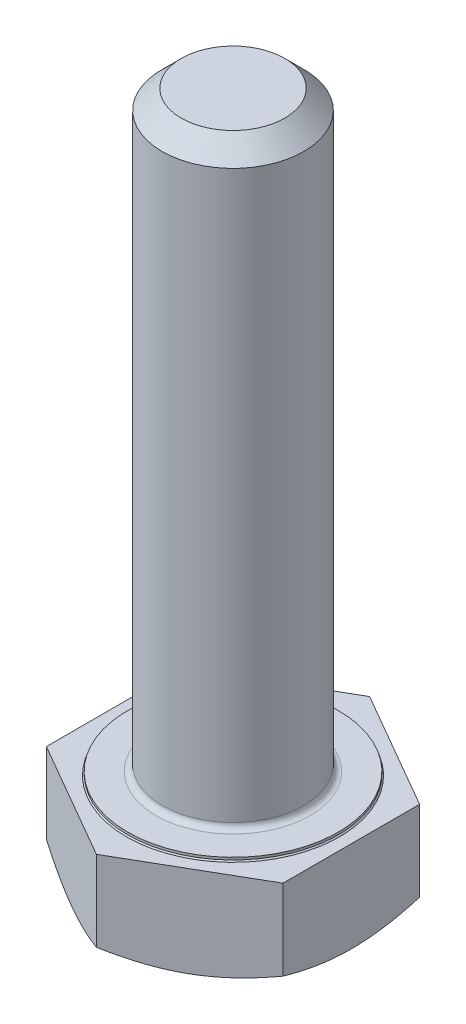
ISO-10303-21;
HEADER;
FILE_DESCRIPTION(('STEP AP214'),'2;1');
FILE_NAME('part.step','',(''),(''),'','','');
FILE_SCHEMA(('AUTOMOTIVE_DESIGN { 1 0 10303 214 1 1 1 1 }'));
ENDSEC;
DATA;
#1=APPLICATION_CONTEXT('core data for automotive mechanical design processes');
#2=APPLICATION_PROTOCOL_DEFINITION('international standard','automotive_design',2000,#1);
#3=PRODUCT_CONTEXT('',#1,'mechanical');
#4=PRODUCT('Part','Part','',(#3));
#5=PRODUCT_RELATED_PRODUCT_CATEGORY('part','',(#4));
#6=PRODUCT_DEFINITION_FORMATION('','',#4);
#7=PRODUCT_DEFINITION_CONTEXT('part definition',#1,'design');
#8=PRODUCT_DEFINITION('design','',#6,#7);
#9=PRODUCT_DEFINITION_SHAPE('','',#8);
#10=(LENGTH_UNIT() NAMED_UNIT(*) SI_UNIT(.MILLI.,.METRE.));
#11=(NAMED_UNIT(*) PLANE_ANGLE_UNIT() SI_UNIT($,.RADIAN.));
#12=(NAMED_UNIT(*) SI_UNIT($,.STERADIAN.) SOLID_ANGLE_UNIT());
#13=UNCERTAINTY_MEASURE_WITH_UNIT(LENGTH_MEASURE(1.E-05),#10,'distance_accuracy_value','');
#14=(GEOMETRIC_REPRESENTATION_CONTEXT(3) GLOBAL_UNCERTAINTY_ASSIGNED_CONTEXT((#13)) GLOBAL_UNIT_ASSIGNED_CONTEXT((#10,
#11,#12)) REPRESENTATION_CONTEXT('',''));
#15=CARTESIAN_POINT('',(0.,0.,0.));
#16=DIRECTION('',(0.,0.,1.));
#17=DIRECTION('',(1.,0.,0.));
#18=AXIS2_PLACEMENT_3D('',#15,#16,#17);
#19=CARTESIAN_POINT('',(0.,-4.,0.));
#20=DIRECTION('',(0.,-1.,0.));
#21=DIRECTION('',(0.,0.,-1.));
#22=AXIS2_PLACEMENT_3D('',#19,#20,#21);
#23=PLANE('',#22);
#24=CARTESIAN_POINT('',(0.,-4.00000000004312,0.));
#25=DIRECTION('',(0.,1.,0.));
#26=DIRECTION('',(0.,0.,1.));
#27=AXIS2_PLACEMENT_3D('',#24,#25,#26);
#28=CIRCLE('',#27,4.99999999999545);
#29=CARTESIAN_POINT('',(-4.99999999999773,-4.00000000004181,0.));
#30=VERTEX_POINT('',#29);
#31=CARTESIAN_POINT('',(-2.50000000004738,-4.00000000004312,4.33012701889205));
#32=VERTEX_POINT('',#31);
#33=EDGE_CURVE('E173',#30,#32,#28,.T.);
#34=ORIENTED_EDGE('',*,*,#33,.F.);
#35=CARTESIAN_POINT('',(0.,-4.00000000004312,0.));
#36=DIRECTION('',(0.,1.,0.));
#37=DIRECTION('',(0.,0.,1.));
#38=AXIS2_PLACEMENT_3D('',#35,#36,#37);
#39=CIRCLE('',#38,4.99999999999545);
#40=CARTESIAN_POINT('',(-2.50000000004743,-4.00000000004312,-4.33012701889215));
#41=VERTEX_POINT('',#40);
#42=EDGE_CURVE('E58',#41,#30,#39,.T.);
#43=ORIENTED_EDGE('',*,*,#42,.F.);
#44=CARTESIAN_POINT('',(0.,-4.00000000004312,0.));
#45=DIRECTION('',(0.,1.,0.));
#46=DIRECTION('',(0.,0.,1.));
#47=AXIS2_PLACEMENT_3D('',#44,#45,#46);
#48=CIRCLE('',#47,4.99999999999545);
#49=CARTESIAN_POINT('',(2.50000000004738,-4.00000000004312,-4.33012701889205));
#50=VERTEX_POINT('',#49);
#51=EDGE_CURVE('E75',#50,#41,#48,.T.);
#52=ORIENTED_EDGE('',*,*,#51,.F.);
#53=CARTESIAN_POINT('',(0.,-4.00000000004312,0.));
#54=DIRECTION('',(0.,1.,0.));
#55=DIRECTION('',(0.,0.,1.));
#56=AXIS2_PLACEMENT_3D('',#53,#54,#55);
#57=CIRCLE('',#56,4.99999999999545);
#58=CARTESIAN_POINT('',(4.99999999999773,-4.00000000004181,0.));
#59=VERTEX_POINT('',#58);
#60=EDGE_CURVE('E73',#59,#50,#57,.T.);
#61=ORIENTED_EDGE('',*,*,#60,.F.);
#62=CARTESIAN_POINT('',(0.,-4.00000000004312,0.));
#63=DIRECTION('',(0.,1.,0.));
#64=DIRECTION('',(0.,0.,1.));
#65=AXIS2_PLACEMENT_3D('',#62,#63,#64);
#66=CIRCLE('',#65,4.99999999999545);
#67=CARTESIAN_POINT('',(2.50000000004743,-4.00000000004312,4.33012701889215));
#68=VERTEX_POINT('',#67);
#69=EDGE_CURVE('E174',#68,#59,#66,.T.);
#70=ORIENTED_EDGE('',*,*,#69,.F.);
#71=CARTESIAN_POINT('',(0.,-4.00000000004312,0.));
#72=DIRECTION('',(0.,1.,0.));
#73=DIRECTION('',(0.,0.,1.));
#74=AXIS2_PLACEMENT_3D('',#71,#72,#73);
#75=CIRCLE('',#74,4.99999999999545);
#76=EDGE_CURVE('E169',#32,#68,#75,.T.);
#77=ORIENTED_EDGE('',*,*,#76,.F.);
#78=EDGE_LOOP('',(#34,#43,#52,#61,#70,#77));
#79=FACE_BOUND('',#78,.T.);
#80=ADVANCED_FACE('F41',(#79),#23,.T.);
#81=CARTESIAN_POINT('',(0.,-3.55073852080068,0.));
#82=DIRECTION('',(0.,1.,0.));
#83=DIRECTION('',(0.,0.,1.));
#84=AXIS2_PLACEMENT_3D('',#81,#82,#83);
#85=CONICAL_SURFACE('',#84,5.7781437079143,1.04719755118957);
#86=CARTESIAN_POINT('',(5.00000000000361,-3.55341801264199,-2.88675134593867));
#87=CARTESIAN_POINT('',(4.79650106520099,-3.62126800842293,-3.00424151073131));
#88=CARTESIAN_POINT('',(4.59137243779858,-3.68343045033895,-3.1226725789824));
#89=CARTESIAN_POINT('',(4.17930699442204,-3.79305279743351,-3.36057867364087));
#90=CARTESIAN_POINT('',(3.97238455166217,-3.84058540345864,-3.48004540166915));
#91=CARTESIAN_POINT('',(3.66004804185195,-3.89894737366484,-3.66037296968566));
#92=CARTESIAN_POINT('',(3.55554132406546,-3.91625229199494,-3.72070995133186));
#93=CARTESIAN_POINT('',(3.34602757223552,-3.94620746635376,-3.84167277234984));
#94=CARTESIAN_POINT('',(3.24102055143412,-3.9588578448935,-3.90229860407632));
#95=CARTESIAN_POINT('',(3.03011778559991,-3.97928167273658,-4.02406337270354));
#96=CARTESIAN_POINT('',(2.92422022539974,-3.9870303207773,-4.08520335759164));
#97=CARTESIAN_POINT('',(2.71221683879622,-3.99740020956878,-4.2076035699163));
#98=CARTESIAN_POINT('',(2.60611097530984,-4.00002043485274,-4.26886381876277));
#99=CARTESIAN_POINT('',(2.50000000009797,-4.00000000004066,-4.33012701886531));
#100=B_SPLINE_CURVE_WITH_KNOTS('',3,(#86,#87,#88,#89,#90,#91,#92,#93,#94,#95,#96,#97,#98,#99),
.UNSPECIFIED.,.F.,.F.,(4,2,2,2,2,2,4),(0.,0.73403665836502,1.46436443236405,1.83000749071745,
2.19564092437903,2.56310985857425,2.93065154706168),.UNSPECIFIED.);
#101=CARTESIAN_POINT('',(5.,-3.55341801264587,-2.886751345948));
#102=VERTEX_POINT('',#101);
#103=EDGE_CURVE('E158',#102,#50,#100,.T.);
#104=ORIENTED_EDGE('',*,*,#103,.F.);
#105=CARTESIAN_POINT('',(4.99999999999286,-4.00000000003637,0.));
#106=CARTESIAN_POINT('',(4.99999999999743,-4.0000204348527,-0.122526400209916));
#107=CARTESIAN_POINT('',(4.99999999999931,-3.99740020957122,-0.245046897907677));
#108=CARTESIAN_POINT('',(5.00000000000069,-3.98703032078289,-0.489847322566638));
#109=CARTESIAN_POINT('',(5.00000000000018,-3.97928167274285,-0.612127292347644));
#110=CARTESIAN_POINT('',(4.99999999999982,-3.95885784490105,-0.855656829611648));
#111=CARTESIAN_POINT('',(4.99999999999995,-3.9462074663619,-0.976908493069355));
#112=CARTESIAN_POINT('',(5.00000000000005,-3.91625229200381,-1.21883413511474));
#113=CARTESIAN_POINT('',(5.00000000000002,-3.89894737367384,-1.33950809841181));
#114=CARTESIAN_POINT('',(4.99999999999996,-3.84058540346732,-1.700163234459));
#115=CARTESIAN_POINT('',(4.99999999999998,-3.79305279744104,-1.9390966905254));
#116=CARTESIAN_POINT('',(5.00000000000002,-3.68343045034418,-2.41490887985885));
#117=CARTESIAN_POINT('',(5.00000000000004,-3.621268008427,-2.65177101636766));
#118=CARTESIAN_POINT('',(5.,-3.55341801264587,-2.88675134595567));
#119=B_SPLINE_CURVE_WITH_KNOTS('',3,(#105,#106,#107,#108,#109,#110,#111,#112,#113,#114,#115,
#116,#117,#118),.UNSPECIFIED.,.F.,.F.,(4,2,2,2,2,2,4),(0.,0.36754168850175,0.735010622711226,
1.10064405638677,1.46628711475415,2.19661488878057,2.93065154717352),.UNSPECIFIED.);
#120=EDGE_CURVE('E308',#59,#102,#119,.T.);
#121=ORIENTED_EDGE('',*,*,#120,.F.);
#122=ORIENTED_EDGE('',*,*,#60,.T.);
#123=EDGE_LOOP('',(#104,#121,#122));
#124=FACE_BOUND('',#123,.T.);
#125=ADVANCED_FACE('F314',(#124),#85,.T.);
#126=CARTESIAN_POINT('',(0.,-3.55073852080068,0.));
#127=DIRECTION('',(0.,1.,0.));
#128=DIRECTION('',(0.,0.,1.));
#129=AXIS2_PLACEMENT_3D('',#126,#127,#128);
#130=CONICAL_SURFACE('',#129,5.7781437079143,1.04719755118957);
#131=CARTESIAN_POINT('',(4.99999999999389,-3.55341801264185,2.88675134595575));
#132=CARTESIAN_POINT('',(4.99999999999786,-3.62126800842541,2.6517710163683));
#133=CARTESIAN_POINT('',(4.99999999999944,-3.6834304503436,2.41490887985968));
#134=CARTESIAN_POINT('',(5.00000000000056,-3.79305279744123,1.93909669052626));
#135=CARTESIAN_POINT('',(5.0000000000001,-3.84058540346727,1.70016323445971));
#136=CARTESIAN_POINT('',(4.99999999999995,-3.8989473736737,1.33950809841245));
#137=CARTESIAN_POINT('',(4.99999999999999,-3.91625229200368,1.21883413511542));
#138=CARTESIAN_POINT('',(5.00000000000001,-3.94620746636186,0.9769084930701));
#139=CARTESIAN_POINT('',(5.,-3.95885784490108,0.85565682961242));
#140=CARTESIAN_POINT('',(5.,-3.97928167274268,0.61212729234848));
#141=CARTESIAN_POINT('',(5.,-3.98703032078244,0.489847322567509));
#142=CARTESIAN_POINT('',(5.,-3.99740020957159,0.245046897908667));
#143=CARTESIAN_POINT('',(5.,-4.00002043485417,0.122526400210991));
#144=CARTESIAN_POINT('',(5.,-4.0000000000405,1.19058183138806E-12));
#145=B_SPLINE_CURVE_WITH_KNOTS('',3,(#131,#132,#133,#134,#135,#136,#137,#138,#139,#140,#141,
#142,#143,#144),.UNSPECIFIED.,.F.,.F.,(4,2,2,2,2,2,4),(0.,0.734036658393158,1.46436443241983,
1.83000749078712,2.19564092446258,2.56310985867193,2.9306515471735),.UNSPECIFIED.);
#146=CARTESIAN_POINT('',(5.,-3.55341801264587,2.886751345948));
#147=VERTEX_POINT('',#146);
#148=EDGE_CURVE('E268',#147,#59,#145,.T.);
#149=ORIENTED_EDGE('',*,*,#148,.F.);
#150=CARTESIAN_POINT('',(2.50000000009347,-4.0000000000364,4.33012701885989));
#151=CARTESIAN_POINT('',(2.60611097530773,-4.00002043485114,4.26886381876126));
#152=CARTESIAN_POINT('',(2.71221683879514,-3.99740020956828,4.20760356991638));
#153=CARTESIAN_POINT('',(2.92422022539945,-3.98703032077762,4.08520335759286));
#154=CARTESIAN_POINT('',(3.0301177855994,-3.97928167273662,4.02406337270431));
#155=CARTESIAN_POINT('',(3.24102055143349,-3.95885784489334,3.90229860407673));
#156=CARTESIAN_POINT('',(3.34602757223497,-3.94620746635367,3.84167277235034));
#157=CARTESIAN_POINT('',(3.55554132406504,-3.91625229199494,3.72070995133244));
#158=CARTESIAN_POINT('',(3.66004804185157,-3.89894737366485,3.66037296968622));
#159=CARTESIAN_POINT('',(3.97238455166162,-3.84058540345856,3.48004540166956));
#160=CARTESIAN_POINT('',(4.17930699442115,-3.7930527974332,3.36057867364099));
#161=CARTESIAN_POINT('',(4.5913724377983,-3.6834304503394,3.12267257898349));
#162=CARTESIAN_POINT('',(4.79650106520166,-3.62126800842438,3.00424151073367));
#163=CARTESIAN_POINT('',(5.00000000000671,-3.55341801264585,2.88675134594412));
#164=B_SPLINE_CURVE_WITH_KNOTS('',3,(#150,#151,#152,#153,#154,#155,#156,#157,#158,#159,#160,
#161,#162,#163),.UNSPECIFIED.,.F.,.F.,(4,2,2,2,2,2,4),(0.,0.367541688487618,0.735010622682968,
1.10064405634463,1.46628711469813,2.19661488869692,2.93065154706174),.UNSPECIFIED.);
#165=EDGE_CURVE('E243',#68,#147,#164,.T.);
#166=ORIENTED_EDGE('',*,*,#165,.F.);
#167=ORIENTED_EDGE('',*,*,#69,.T.);
#168=EDGE_LOOP('',(#149,#166,#167));
#169=FACE_BOUND('',#168,.T.);
#170=ADVANCED_FACE('F276',(#169),#130,.T.);
#171=CARTESIAN_POINT('',(0.,-3.55073852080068,0.));
#172=DIRECTION('',(0.,1.,0.));
#173=DIRECTION('',(0.,0.,1.));
#174=AXIS2_PLACEMENT_3D('',#171,#172,#173);
#175=CONICAL_SURFACE('',#174,5.7781437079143,1.04719755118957);
#176=CARTESIAN_POINT('',(-9.70357000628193E-12,-3.55341801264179,5.7735026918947));
#177=CARTESIAN_POINT('',(0.203498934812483,-3.621268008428,5.65601252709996));
#178=CARTESIAN_POINT('',(0.408627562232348,-3.68343045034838,5.53758145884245));
#179=CARTESIAN_POINT('',(0.820693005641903,-3.7930527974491,5.29967536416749));
#180=CARTESIAN_POINT('',(1.02761544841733,-3.84058540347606,5.18020863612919));
#181=CARTESIAN_POINT('',(1.33995195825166,-3.89894737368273,4.9998810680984));
#182=CARTESIAN_POINT('',(1.44445867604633,-3.9162522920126,4.93954408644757));
#183=CARTESIAN_POINT('',(1.65397242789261,-3.94620746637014,4.81858126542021));
#184=CARTESIAN_POINT('',(1.75897944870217,-3.95885784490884,4.757955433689));
#185=CARTESIAN_POINT('',(1.96988221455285,-3.97928167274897,4.63619066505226));
#186=CARTESIAN_POINT('',(2.07577977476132,-3.98703032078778,4.57505068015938));
#187=CARTESIAN_POINT('',(2.28778316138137,-3.99740020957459,4.45265046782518));
#188=CARTESIAN_POINT('',(2.39388902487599,-4.00002043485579,4.39139021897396));
#189=CARTESIAN_POINT('',(2.50000000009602,-4.00000000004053,4.33012701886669));
#190=B_SPLINE_CURVE_WITH_KNOTS('',3,(#176,#177,#178,#179,#180,#181,#182,#183,#184,#185,#186,
#187,#188,#189),.UNSPECIFIED.,.F.,.F.,(4,2,2,2,2,2,4),(0.,0.734036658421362,1.46436443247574,
1.83000749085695,2.19564092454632,2.56310985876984,2.93065154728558),.UNSPECIFIED.);
#191=CARTESIAN_POINT('',(0.,-3.55341801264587,5.77350269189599));
#192=VERTEX_POINT('',#191);
#193=EDGE_CURVE('E286',#192,#68,#190,.T.);
#194=ORIENTED_EDGE('',*,*,#193,.F.);
#195=CARTESIAN_POINT('',(-2.50000000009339,-4.00000000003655,4.33012701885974));
#196=CARTESIAN_POINT('',(-2.39388902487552,-4.00002043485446,4.39139021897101));
#197=CARTESIAN_POINT('',(-2.28778316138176,-3.99740020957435,4.4526504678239));
#198=CARTESIAN_POINT('',(-2.07577977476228,-3.98703032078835,4.57505068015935));
#199=CARTESIAN_POINT('',(-1.96988221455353,-3.97928167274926,4.63619066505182));
#200=CARTESIAN_POINT('',(-1.7589794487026,-3.95885784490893,4.75795543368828));
#201=CARTESIAN_POINT('',(-1.65397242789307,-3.94620746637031,4.81858126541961));
#202=CARTESIAN_POINT('',(-1.44445867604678,-3.91625229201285,4.93954408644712));
#203=CARTESIAN_POINT('',(-1.33995195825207,-3.89894737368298,4.99988106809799));
#204=CARTESIAN_POINT('',(-1.02761544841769,-3.84058540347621,5.18020863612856));
#205=CARTESIAN_POINT('',(-0.820693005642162,-3.793052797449,5.29967536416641));
#206=CARTESIAN_POINT('',(-0.40862756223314,-3.68343045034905,5.53758145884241));
#207=CARTESIAN_POINT('',(-0.20349893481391,-3.62126800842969,5.65601252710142));
#208=CARTESIAN_POINT('',(6.78572330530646E-12,-3.55341801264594,5.77350269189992));
#209=B_SPLINE_CURVE_WITH_KNOTS('',3,(#195,#196,#197,#198,#199,#200,#201,#202,#203,#204,#205,
#206,#207,#208),.UNSPECIFIED.,.F.,.F.,(4,2,2,2,2,2,4),(0.,0.367541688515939,0.735010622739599,
1.10064405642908,1.4662871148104,2.19661488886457,2.93065154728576),.UNSPECIFIED.);
#210=EDGE_CURVE('E242',#32,#192,#209,.T.);
#211=ORIENTED_EDGE('',*,*,#210,.F.);
#212=ORIENTED_EDGE('',*,*,#76,.T.);
#213=EDGE_LOOP('',(#194,#211,#212));
#214=FACE_BOUND('',#213,.T.);
#215=ADVANCED_FACE('F272',(#214),#175,.T.);
#216=CARTESIAN_POINT('',(0.,-3.55073852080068,0.));
#217=DIRECTION('',(0.,1.,0.));
#218=DIRECTION('',(0.,0.,1.));
#219=AXIS2_PLACEMENT_3D('',#216,#217,#218);
#220=CONICAL_SURFACE('',#219,5.7781437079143,1.04719755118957);
#221=CARTESIAN_POINT('',(-5.00000000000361,-3.55341801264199,2.88675134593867));
#222=CARTESIAN_POINT('',(-4.79650106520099,-3.62126800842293,3.00424151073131));
#223=CARTESIAN_POINT('',(-4.59137243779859,-3.68343045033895,3.1226725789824));
#224=CARTESIAN_POINT('',(-4.17930699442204,-3.79305279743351,3.36057867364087));
#225=CARTESIAN_POINT('',(-3.97238455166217,-3.84058540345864,3.48004540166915));
#226=CARTESIAN_POINT('',(-3.66004804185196,-3.89894737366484,3.66037296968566));
#227=CARTESIAN_POINT('',(-3.55554132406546,-3.91625229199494,3.72070995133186));
#228=CARTESIAN_POINT('',(-3.34602757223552,-3.94620746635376,3.84167277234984));
#229=CARTESIAN_POINT('',(-3.24102055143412,-3.9588578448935,3.90229860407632));
#230=CARTESIAN_POINT('',(-3.03011778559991,-3.97928167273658,4.02406337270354));
#231=CARTESIAN_POINT('',(-2.92422022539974,-3.9870303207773,4.08520335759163));
#232=CARTESIAN_POINT('',(-2.71221683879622,-3.99740020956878,4.2076035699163));
#233=CARTESIAN_POINT('',(-2.60611097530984,-4.00002043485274,4.26886381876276));
#234=CARTESIAN_POINT('',(-2.50000000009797,-4.00000000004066,4.33012701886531));
#235=B_SPLINE_CURVE_WITH_KNOTS('',3,(#221,#222,#223,#224,#225,#226,#227,#228,#229,#230,#231,
#232,#233,#234),.UNSPECIFIED.,.F.,.F.,(4,2,2,2,2,2,4),(0.,0.734036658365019,1.46436443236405,
1.83000749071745,2.19564092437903,2.56310985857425,2.93065154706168),.UNSPECIFIED.);
#236=CARTESIAN_POINT('',(-5.,-3.55341801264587,2.8867513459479));
#237=VERTEX_POINT('',#236);
#238=EDGE_CURVE('E238',#237,#32,#235,.T.);
#239=ORIENTED_EDGE('',*,*,#238,.F.);
#240=CARTESIAN_POINT('',(-4.99999999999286,-4.00000000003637,0.));
#241=CARTESIAN_POINT('',(-4.99999999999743,-4.0000204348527,0.122526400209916));
#242=CARTESIAN_POINT('',(-4.99999999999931,-3.99740020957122,0.245046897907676));
#243=CARTESIAN_POINT('',(-5.00000000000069,-3.98703032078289,0.489847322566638));
#244=CARTESIAN_POINT('',(-5.00000000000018,-3.97928167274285,0.612127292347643));
#245=CARTESIAN_POINT('',(-4.99999999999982,-3.95885784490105,0.855656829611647));
#246=CARTESIAN_POINT('',(-4.99999999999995,-3.9462074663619,0.976908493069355));
#247=CARTESIAN_POINT('',(-5.00000000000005,-3.91625229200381,1.21883413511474));
#248=CARTESIAN_POINT('',(-5.00000000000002,-3.89894737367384,1.33950809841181));
#249=CARTESIAN_POINT('',(-4.99999999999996,-3.84058540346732,1.700163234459));
#250=CARTESIAN_POINT('',(-4.99999999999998,-3.79305279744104,1.9390966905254));
#251=CARTESIAN_POINT('',(-5.00000000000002,-3.68343045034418,2.41490887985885));
#252=CARTESIAN_POINT('',(-5.00000000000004,-3.621268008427,2.65177101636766));
#253=CARTESIAN_POINT('',(-5.,-3.55341801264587,2.88675134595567));
#254=B_SPLINE_CURVE_WITH_KNOTS('',3,(#240,#241,#242,#243,#244,#245,#246,#247,#248,#249,#250,
#251,#252,#253),.UNSPECIFIED.,.F.,.F.,(4,2,2,2,2,2,4),(0.,0.36754168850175,0.735010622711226,
1.10064405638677,1.46628711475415,2.19661488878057,2.93065154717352),.UNSPECIFIED.);
#255=EDGE_CURVE('E249',#30,#237,#254,.T.);
#256=ORIENTED_EDGE('',*,*,#255,.F.);
#257=ORIENTED_EDGE('',*,*,#33,.T.);
#258=EDGE_LOOP('',(#239,#256,#257));
#259=FACE_BOUND('',#258,.T.);
#260=ADVANCED_FACE('F206',(#259),#220,.T.);
#261=CARTESIAN_POINT('',(0.,-3.55073852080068,0.));
#262=DIRECTION('',(0.,1.,0.));
#263=DIRECTION('',(0.,0.,1.));
#264=AXIS2_PLACEMENT_3D('',#261,#262,#263);
#265=CONICAL_SURFACE('',#264,5.7781437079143,1.04719755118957);
#266=CARTESIAN_POINT('',(9.67539593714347E-12,-3.55341801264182,-5.77350269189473));
#267=CARTESIAN_POINT('',(-0.203498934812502,-3.62126800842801,-5.65601252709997));
#268=CARTESIAN_POINT('',(-0.408627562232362,-3.68343045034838,-5.53758145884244));
#269=CARTESIAN_POINT('',(-0.820693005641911,-3.7930527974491,-5.29967536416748));
#270=CARTESIAN_POINT('',(-1.02761544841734,-3.84058540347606,-5.18020863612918));
#271=CARTESIAN_POINT('',(-1.33995195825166,-3.89894737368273,-4.9998810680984));
#272=CARTESIAN_POINT('',(-1.44445867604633,-3.9162522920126,-4.93954408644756));
#273=CARTESIAN_POINT('',(-1.65397242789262,-3.94620746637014,-4.81858126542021));
#274=CARTESIAN_POINT('',(-1.75897944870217,-3.95885784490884,-4.757955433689));
#275=CARTESIAN_POINT('',(-1.96988221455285,-3.97928167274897,-4.63619066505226));
#276=CARTESIAN_POINT('',(-2.07577977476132,-3.98703032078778,-4.57505068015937));
#277=CARTESIAN_POINT('',(-2.28778316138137,-3.99740020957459,-4.45265046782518));
#278=CARTESIAN_POINT('',(-2.39388902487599,-4.00002043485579,-4.39139021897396));
#279=CARTESIAN_POINT('',(-2.50000000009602,-4.00000000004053,-4.33012701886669));
#280=B_SPLINE_CURVE_WITH_KNOTS('',3,(#266,#267,#268,#269,#270,#271,#272,#273,#274,#275,#276,
#277,#278,#279),.UNSPECIFIED.,.F.,.F.,(4,2,2,2,2,2,4),(0.,0.734036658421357,1.46436443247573,
1.83000749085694,2.19564092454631,2.56310985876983,2.93065154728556),.UNSPECIFIED.);
#281=CARTESIAN_POINT('',(0.,-3.55341801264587,-5.773502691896));
#282=VERTEX_POINT('',#281);
#283=EDGE_CURVE('E195',#282,#41,#280,.T.);
#284=ORIENTED_EDGE('',*,*,#283,.F.);
#285=CARTESIAN_POINT('',(2.50000000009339,-4.00000000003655,-4.33012701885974));
#286=CARTESIAN_POINT('',(2.39388902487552,-4.00002043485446,-4.39139021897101));
#287=CARTESIAN_POINT('',(2.28778316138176,-3.99740020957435,-4.4526504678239));
#288=CARTESIAN_POINT('',(2.07577977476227,-3.98703032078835,-4.57505068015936));
#289=CARTESIAN_POINT('',(1.96988221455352,-3.97928167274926,-4.63619066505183));
#290=CARTESIAN_POINT('',(1.75897944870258,-3.95885784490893,-4.75795543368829));
#291=CARTESIAN_POINT('',(1.65397242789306,-3.94620746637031,-4.81858126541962));
#292=CARTESIAN_POINT('',(1.44445867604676,-3.91625229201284,-4.93954408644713));
#293=CARTESIAN_POINT('',(1.33995195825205,-3.89894737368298,-4.999881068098));
#294=CARTESIAN_POINT('',(1.02761544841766,-3.84058540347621,-5.18020863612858));
#295=CARTESIAN_POINT('',(0.820693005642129,-3.793052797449,-5.29967536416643));
#296=CARTESIAN_POINT('',(0.408627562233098,-3.68343045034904,-5.53758145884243));
#297=CARTESIAN_POINT('',(0.203498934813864,-3.62126800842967,-5.65601252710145));
#298=CARTESIAN_POINT('',(-6.83455675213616E-12,-3.55341801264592,-5.77350269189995));
#299=B_SPLINE_CURVE_WITH_KNOTS('',3,(#285,#286,#287,#288,#289,#290,#291,#292,#293,#294,#295,
#296,#297,#298),.UNSPECIFIED.,.F.,.F.,(4,2,2,2,2,2,4),(0.,0.367541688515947,0.735010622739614,
1.1006440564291,1.46628711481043,2.19661488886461,2.93065154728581),.UNSPECIFIED.);
#300=EDGE_CURVE('E143',#50,#282,#299,.T.);
#301=ORIENTED_EDGE('',*,*,#300,.F.);
#302=ORIENTED_EDGE('',*,*,#51,.T.);
#303=EDGE_LOOP('',(#284,#301,#302));
#304=FACE_BOUND('',#303,.T.);
#305=ADVANCED_FACE('F201',(#304),#265,.T.);
#306=CARTESIAN_POINT('',(0.,-3.55073852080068,0.));
#307=DIRECTION('',(0.,1.,0.));
#308=DIRECTION('',(0.,0.,1.));
#309=AXIS2_PLACEMENT_3D('',#306,#307,#308);
#310=CONICAL_SURFACE('',#309,5.7781437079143,1.04719755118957);
#311=CARTESIAN_POINT('',(-4.99999999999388,-3.55341801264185,-2.88675134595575));
#312=CARTESIAN_POINT('',(-4.99999999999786,-3.62126800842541,-2.6517710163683));
#313=CARTESIAN_POINT('',(-4.99999999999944,-3.6834304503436,-2.41490887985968));
#314=CARTESIAN_POINT('',(-5.00000000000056,-3.79305279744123,-1.93909669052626));
#315=CARTESIAN_POINT('',(-5.0000000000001,-3.84058540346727,-1.70016323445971));
#316=CARTESIAN_POINT('',(-4.99999999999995,-3.8989473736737,-1.33950809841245));
#317=CARTESIAN_POINT('',(-4.99999999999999,-3.91625229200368,-1.21883413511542));
#318=CARTESIAN_POINT('',(-5.00000000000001,-3.94620746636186,-0.9769084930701));
#319=CARTESIAN_POINT('',(-5.,-3.95885784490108,-0.855656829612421));
#320=CARTESIAN_POINT('',(-5.,-3.97928167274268,-0.612127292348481));
#321=CARTESIAN_POINT('',(-5.,-3.98703032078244,-0.48984732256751));
#322=CARTESIAN_POINT('',(-5.,-3.99740020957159,-0.245046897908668));
#323=CARTESIAN_POINT('',(-5.,-4.00002043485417,-0.122526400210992));
#324=CARTESIAN_POINT('',(-5.,-4.0000000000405,-1.19123229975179E-12));
#325=B_SPLINE_CURVE_WITH_KNOTS('',3,(#311,#312,#313,#314,#315,#316,#317,#318,#319,#320,#321,
#322,#323,#324),.UNSPECIFIED.,.F.,.F.,(4,2,2,2,2,2,4),(0.,0.734036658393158,1.46436443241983,
1.83000749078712,2.19564092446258,2.56310985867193,2.9306515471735),.UNSPECIFIED.);
#326=CARTESIAN_POINT('',(-5.,-3.55341801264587,-2.886751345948));
#327=VERTEX_POINT('',#326);
#328=EDGE_CURVE('E218',#327,#30,#325,.T.);
#329=ORIENTED_EDGE('',*,*,#328,.F.);
#330=CARTESIAN_POINT('',(-2.50000000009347,-4.0000000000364,-4.33012701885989));
#331=CARTESIAN_POINT('',(-2.60611097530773,-4.00002043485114,-4.26886381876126));
#332=CARTESIAN_POINT('',(-2.71221683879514,-3.99740020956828,-4.20760356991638));
#333=CARTESIAN_POINT('',(-2.92422022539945,-3.98703032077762,-4.08520335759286));
#334=CARTESIAN_POINT('',(-3.0301177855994,-3.97928167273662,-4.02406337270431));
#335=CARTESIAN_POINT('',(-3.24102055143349,-3.95885784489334,-3.90229860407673));
#336=CARTESIAN_POINT('',(-3.34602757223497,-3.94620746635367,-3.84167277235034));
#337=CARTESIAN_POINT('',(-3.55554132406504,-3.91625229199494,-3.72070995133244));
#338=CARTESIAN_POINT('',(-3.66004804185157,-3.89894737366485,-3.66037296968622));
#339=CARTESIAN_POINT('',(-3.97238455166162,-3.84058540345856,-3.48004540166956));
#340=CARTESIAN_POINT('',(-4.17930699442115,-3.7930527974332,-3.36057867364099));
#341=CARTESIAN_POINT('',(-4.5913724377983,-3.6834304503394,-3.12267257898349));
#342=CARTESIAN_POINT('',(-4.79650106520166,-3.62126800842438,-3.00424151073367));
#343=CARTESIAN_POINT('',(-5.00000000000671,-3.55341801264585,-2.88675134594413));
#344=B_SPLINE_CURVE_WITH_KNOTS('',3,(#330,#331,#332,#333,#334,#335,#336,#337,#338,#339,#340,
#341,#342,#343),.UNSPECIFIED.,.F.,.F.,(4,2,2,2,2,2,4),(0.,0.367541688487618,0.735010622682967,
1.10064405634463,1.46628711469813,2.19661488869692,2.93065154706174),.UNSPECIFIED.);
#345=EDGE_CURVE('E237',#41,#327,#344,.T.);
#346=ORIENTED_EDGE('',*,*,#345,.F.);
#347=ORIENTED_EDGE('',*,*,#42,.T.);
#348=EDGE_LOOP('',(#329,#346,#347));
#349=FACE_BOUND('',#348,.T.);
#350=ADVANCED_FACE('F205',(#349),#310,.T.);
#351=CARTESIAN_POINT('',(0.,0.,-5.773502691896));
#352=DIRECTION('',(0.500000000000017,0.,-0.866025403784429));
#353=DIRECTION('',(-0.866025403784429,0.,-0.500000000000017));
#354=AXIS2_PLACEMENT_3D('',#351,#352,#353);
#355=PLANE('',#354);
#356=ORIENTED_EDGE('',*,*,#300,.T.);
#357=DIRECTION('',(0.,-1.,0.));
#358=VECTOR('',#357,1.);
#359=CARTESIAN_POINT('',(0.,-0.15,-5.773502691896));
#360=LINE('',#359,#358);
#361=CARTESIAN_POINT('',(0.,-0.15,-5.773502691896));
#362=VERTEX_POINT('',#361);
#363=EDGE_CURVE('E139',#362,#282,#360,.T.);
#364=ORIENTED_EDGE('',*,*,#363,.F.);
#365=DIRECTION('',(-0.866025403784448,0.,-0.499999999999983));
#366=VECTOR('',#365,1.);
#367=CARTESIAN_POINT('',(0.,-0.15,-5.773502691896));
#368=LINE('',#367,#366);
#369=CARTESIAN_POINT('',(5.,-0.15,-2.886751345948));
#370=VERTEX_POINT('',#369);
#371=EDGE_CURVE('E128',#370,#362,#368,.T.);
#372=ORIENTED_EDGE('',*,*,#371,.F.);
#373=DIRECTION('',(0.,-1.,0.));
#374=VECTOR('',#373,1.);
#375=CARTESIAN_POINT('',(5.,-0.15,-2.886751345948));
#376=LINE('',#375,#374);
#377=EDGE_CURVE('E147',#370,#102,#376,.T.);
#378=ORIENTED_EDGE('',*,*,#377,.T.);
#379=ORIENTED_EDGE('',*,*,#103,.T.);
#380=EDGE_LOOP('',(#356,#364,#372,#378,#379));
#381=FACE_BOUND('',#380,.T.);
#382=ADVANCED_FACE('F140',(#381),#355,.T.);
#383=CARTESIAN_POINT('',(5.,0.,-2.886751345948));
#384=DIRECTION('',(1.,0.,0.));
#385=DIRECTION('',(0.,0.,-1.));
#386=AXIS2_PLACEMENT_3D('',#383,#384,#385);
#387=PLANE('',#386);
#388=ORIENTED_EDGE('',*,*,#120,.T.);
#389=ORIENTED_EDGE('',*,*,#377,.F.);
#390=DIRECTION('',(0.,0.,-1.));
#391=VECTOR('',#390,1.);
#392=CARTESIAN_POINT('',(5.,-0.15,-2.886751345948));
#393=LINE('',#392,#391);
#394=CARTESIAN_POINT('',(5.,-0.15,2.886751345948));
#395=VERTEX_POINT('',#394);
#396=EDGE_CURVE('E134',#395,#370,#393,.T.);
#397=ORIENTED_EDGE('',*,*,#396,.F.);
#398=DIRECTION('',(0.,-1.,0.));
#399=VECTOR('',#398,1.);
#400=CARTESIAN_POINT('',(5.,-0.15,2.886751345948));
#401=LINE('',#400,#399);
#402=EDGE_CURVE('E702',#395,#147,#401,.T.);
#403=ORIENTED_EDGE('',*,*,#402,.T.);
#404=ORIENTED_EDGE('',*,*,#148,.T.);
#405=EDGE_LOOP('',(#388,#389,#397,#403,#404));
#406=FACE_BOUND('',#405,.T.);
#407=ADVANCED_FACE('F312',(#406),#387,.T.);
#408=CARTESIAN_POINT('',(5.,0.,2.886751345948));
#409=DIRECTION('',(0.500000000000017,0.,0.866025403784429));
#410=DIRECTION('',(0.866025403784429,0.,-0.500000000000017));
#411=AXIS2_PLACEMENT_3D('',#408,#409,#410);
#412=PLANE('',#411);
#413=ORIENTED_EDGE('',*,*,#165,.T.);
#414=ORIENTED_EDGE('',*,*,#402,.F.);
#415=DIRECTION('',(0.866025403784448,0.,-0.499999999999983));
#416=VECTOR('',#415,1.);
#417=CARTESIAN_POINT('',(5.,-0.15,2.886751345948));
#418=LINE('',#417,#416);
#419=CARTESIAN_POINT('',(0.,-0.15,5.77350269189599));
#420=VERTEX_POINT('',#419);
#421=EDGE_CURVE('E121',#420,#395,#418,.T.);
#422=ORIENTED_EDGE('',*,*,#421,.F.);
#423=DIRECTION('',(0.,-1.,0.));
#424=VECTOR('',#423,1.);
#425=CARTESIAN_POINT('',(0.,-0.15,5.77350269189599));
#426=LINE('',#425,#424);
#427=EDGE_CURVE('E182',#420,#192,#426,.T.);
#428=ORIENTED_EDGE('',*,*,#427,.T.);
#429=ORIENTED_EDGE('',*,*,#193,.T.);
#430=EDGE_LOOP('',(#413,#414,#422,#428,#429));
#431=FACE_BOUND('',#430,.T.);
#432=ADVANCED_FACE('F257',(#431),#412,.T.);
#433=CARTESIAN_POINT('',(0.,0.,5.773502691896));
#434=DIRECTION('',(-0.500000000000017,0.,0.866025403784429));
#435=DIRECTION('',(0.866025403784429,0.,0.500000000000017));
#436=AXIS2_PLACEMENT_3D('',#433,#434,#435);
#437=PLANE('',#436);
#438=ORIENTED_EDGE('',*,*,#210,.T.);
#439=ORIENTED_EDGE('',*,*,#427,.F.);
#440=DIRECTION('',(0.866025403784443,0.,0.499999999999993));
#441=VECTOR('',#440,1.);
#442=CARTESIAN_POINT('',(0.,-0.15,5.77350269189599));
#443=LINE('',#442,#441);
#444=CARTESIAN_POINT('',(-5.,-0.15,2.8867513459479));
#445=VERTEX_POINT('',#444);
#446=EDGE_CURVE('E716',#445,#420,#443,.T.);
#447=ORIENTED_EDGE('',*,*,#446,.F.);
#448=DIRECTION('',(0.,-1.,0.));
#449=VECTOR('',#448,1.);
#450=CARTESIAN_POINT('',(-5.,-0.15,2.8867513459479));
#451=LINE('',#450,#449);
#452=EDGE_CURVE('E113',#445,#237,#451,.T.);
#453=ORIENTED_EDGE('',*,*,#452,.T.);
#454=ORIENTED_EDGE('',*,*,#238,.T.);
#455=EDGE_LOOP('',(#438,#439,#447,#453,#454));
#456=FACE_BOUND('',#455,.T.);
#457=ADVANCED_FACE('F253',(#456),#437,.T.);
#458=CARTESIAN_POINT('',(-5.,0.,2.886751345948));
#459=DIRECTION('',(-1.,0.,0.));
#460=DIRECTION('',(0.,0.,1.));
#461=AXIS2_PLACEMENT_3D('',#458,#459,#460);
#462=PLANE('',#461);
#463=ORIENTED_EDGE('',*,*,#255,.T.);
#464=ORIENTED_EDGE('',*,*,#452,.F.);
#465=DIRECTION('',(0.,0.,1.));
#466=VECTOR('',#465,1.);
#467=CARTESIAN_POINT('',(-5.,-0.15,2.8867513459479));
#468=LINE('',#467,#466);
#469=CARTESIAN_POINT('',(-5.,-0.15,-2.886751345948));
#470=VERTEX_POINT('',#469);
#471=EDGE_CURVE('E90',#470,#445,#468,.T.);
#472=ORIENTED_EDGE('',*,*,#471,.F.);
#473=DIRECTION('',(0.,-1.,0.));
#474=VECTOR('',#473,1.);
#475=CARTESIAN_POINT('',(-5.,-0.15,-2.886751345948));
#476=LINE('',#475,#474);
#477=EDGE_CURVE('E82',#470,#327,#476,.T.);
#478=ORIENTED_EDGE('',*,*,#477,.T.);
#479=ORIENTED_EDGE('',*,*,#328,.T.);
#480=EDGE_LOOP('',(#463,#464,#472,#478,#479));
#481=FACE_BOUND('',#480,.T.);
#482=ADVANCED_FACE('F226',(#481),#462,.T.);
#483=CARTESIAN_POINT('',(-5.,0.,-2.886751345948));
#484=DIRECTION('',(-0.500000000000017,0.,-0.866025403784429));
#485=DIRECTION('',(-0.866025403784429,0.,0.500000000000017));
#486=AXIS2_PLACEMENT_3D('',#483,#484,#485);
#487=PLANE('',#486);
#488=ORIENTED_EDGE('',*,*,#345,.T.);
#489=ORIENTED_EDGE('',*,*,#477,.F.);
#490=DIRECTION('',(-0.866025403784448,0.,0.499999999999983));
#491=VECTOR('',#490,1.);
#492=CARTESIAN_POINT('',(-5.,-0.15,-2.886751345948));
#493=LINE('',#492,#491);
#494=EDGE_CURVE('E132',#362,#470,#493,.T.);
#495=ORIENTED_EDGE('',*,*,#494,.F.);
#496=ORIENTED_EDGE('',*,*,#363,.T.);
#497=ORIENTED_EDGE('',*,*,#283,.T.);
#498=EDGE_LOOP('',(#488,#489,#495,#496,#497));
#499=FACE_BOUND('',#498,.T.);
#500=ADVANCED_FACE('F150',(#499),#487,.T.);
#501=CARTESIAN_POINT('',(0.,-0.15,0.));
#502=DIRECTION('',(0.,-1.,0.));
#503=DIRECTION('',(0.,0.,-1.));
#504=AXIS2_PLACEMENT_3D('',#501,#502,#503);
#505=PLANE('',#504);
#506=CARTESIAN_POINT('',(0.,-0.15,0.));
#507=DIRECTION('',(0.,-1.,0.));
#508=DIRECTION('',(0.,0.,-1.));
#509=AXIS2_PLACEMENT_3D('',#506,#507,#508);
#510=CIRCLE('',#509,4.50000000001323);
#511=CARTESIAN_POINT('',(0.,-0.15,-4.50000000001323));
#512=VERTEX_POINT('',#511);
#513=EDGE_CURVE('E486',#512,#512,#510,.T.);
#514=ORIENTED_EDGE('',*,*,#513,.T.);
#515=EDGE_LOOP('',(#514));
#516=FACE_BOUND('',#515,.T.);
#517=ORIENTED_EDGE('',*,*,#446,.T.);
#518=ORIENTED_EDGE('',*,*,#421,.T.);
#519=ORIENTED_EDGE('',*,*,#396,.T.);
#520=ORIENTED_EDGE('',*,*,#371,.T.);
#521=ORIENTED_EDGE('',*,*,#494,.T.);
#522=ORIENTED_EDGE('',*,*,#471,.T.);
#523=EDGE_LOOP('',(#517,#518,#519,#520,#521,#522));
#524=FACE_BOUND('',#523,.T.);
#525=ADVANCED_FACE('F130',(#516,#524),#505,.F.);
#526=CARTESIAN_POINT('',(0.,25.,0.));
#527=DIRECTION('',(0.,-1.,0.));
#528=DIRECTION('',(0.,0.,-1.));
#529=AXIS2_PLACEMENT_3D('',#526,#527,#528);
#530=CYLINDRICAL_SURFACE('',#529,3.);
#531=CARTESIAN_POINT('',(0.,0.25,0.));
#532=DIRECTION('',(0.,1.,0.));
#533=DIRECTION('',(0.,0.,1.));
#534=AXIS2_PLACEMENT_3D('',#531,#532,#533);
#535=CIRCLE('',#534,3.);
#536=CARTESIAN_POINT('',(0.,0.25,3.));
#537=VERTEX_POINT('',#536);
#538=EDGE_CURVE('E13',#537,#537,#535,.T.);
#539=ORIENTED_EDGE('',*,*,#538,.T.);
#540=EDGE_LOOP('',(#539));
#541=FACE_BOUND('',#540,.T.);
#542=CARTESIAN_POINT('',(0.,24.1881249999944,0.));
#543=DIRECTION('',(0.,1.,0.));
#544=DIRECTION('',(0.,0.,1.));
#545=AXIS2_PLACEMENT_3D('',#542,#543,#544);
#546=CIRCLE('',#545,3.);
#547=CARTESIAN_POINT('',(0.,24.1881249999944,3.));
#548=VERTEX_POINT('',#547);
#549=EDGE_CURVE('E476',#548,#548,#546,.F.);
#550=ORIENTED_EDGE('',*,*,#549,.T.);
#551=EDGE_LOOP('',(#550));
#552=FACE_BOUND('',#551,.T.);
#553=ADVANCED_FACE('F511',(#541,#552),#530,.T.);
#554=CARTESIAN_POINT('',(3.,25.,0.));
#555=DIRECTION('',(0.,1.,0.));
#556=DIRECTION('',(0.,0.,1.));
#557=AXIS2_PLACEMENT_3D('',#554,#555,#556);
#558=PLANE('',#557);
#559=CARTESIAN_POINT('',(0.,25.,0.));
#560=DIRECTION('',(0.,1.,0.));
#561=DIRECTION('',(0.,0.,1.));
#562=AXIS2_PLACEMENT_3D('',#559,#560,#561);
#563=CIRCLE('',#562,2.18812499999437);
#564=CARTESIAN_POINT('',(0.,25.,2.18812499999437));
#565=VERTEX_POINT('',#564);
#566=EDGE_CURVE('E481',#565,#565,#563,.T.);
#567=ORIENTED_EDGE('',*,*,#566,.T.);
#568=EDGE_LOOP('',(#567));
#569=FACE_BOUND('',#568,.T.);
#570=ADVANCED_FACE('F513',(#569),#558,.T.);
#571=CARTESIAN_POINT('',(0.,25.,0.));
#572=DIRECTION('',(0.,-1.,0.));
#573=DIRECTION('',(0.,0.,-1.));
#574=AXIS2_PLACEMENT_3D('',#571,#572,#573);
#575=CYLINDRICAL_SURFACE('',#574,4.45);
#576=CARTESIAN_POINT('',(0.,-0.0999999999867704,0.));
#577=DIRECTION('',(0.,-1.,0.));
#578=DIRECTION('',(0.,0.,-1.));
#579=AXIS2_PLACEMENT_3D('',#576,#577,#578);
#580=CIRCLE('',#579,4.45);
#581=CARTESIAN_POINT('',(0.,-0.0999999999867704,-4.45));
#582=VERTEX_POINT('',#581);
#583=EDGE_CURVE('E493',#582,#582,#580,.F.);
#584=ORIENTED_EDGE('',*,*,#583,.T.);
#585=EDGE_LOOP('',(#584));
#586=FACE_BOUND('',#585,.T.);
#587=CARTESIAN_POINT('',(0.,0.,0.));
#588=DIRECTION('',(0.,-1.,0.));
#589=DIRECTION('',(0.,0.,-1.));
#590=AXIS2_PLACEMENT_3D('',#587,#588,#589);
#591=CIRCLE('',#590,4.45);
#592=CARTESIAN_POINT('',(0.,0.,-4.45));
#593=VERTEX_POINT('',#592);
#594=EDGE_CURVE('E717',#593,#593,#591,.T.);
#595=ORIENTED_EDGE('',*,*,#594,.T.);
#596=EDGE_LOOP('',(#595));
#597=FACE_BOUND('',#596,.T.);
#598=ADVANCED_FACE('F518',(#586,#597),#575,.T.);
#599=CARTESIAN_POINT('',(4.45,0.,0.));
#600=DIRECTION('',(0.,1.,0.));
#601=DIRECTION('',(0.,0.,1.));
#602=AXIS2_PLACEMENT_3D('',#599,#600,#601);
#603=PLANE('',#602);
#604=CARTESIAN_POINT('',(0.,0.,0.));
#605=DIRECTION('',(0.,1.,0.));
#606=DIRECTION('',(0.,0.,1.));
#607=AXIS2_PLACEMENT_3D('',#604,#605,#606);
#608=CIRCLE('',#607,3.25);
#609=CARTESIAN_POINT('',(0.,0.,3.25));
#610=VERTEX_POINT('',#609);
#611=EDGE_CURVE('E50',#610,#610,#608,.F.);
#612=ORIENTED_EDGE('',*,*,#611,.T.);
#613=EDGE_LOOP('',(#612));
#614=FACE_BOUND('',#613,.T.);
#615=ORIENTED_EDGE('',*,*,#594,.F.);
#616=EDGE_LOOP('',(#615));
#617=FACE_BOUND('',#616,.T.);
#618=ADVANCED_FACE('F498',(#614,#617),#603,.T.);
#619=CARTESIAN_POINT('',(0.,24.1881249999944,0.));
#620=DIRECTION('',(0.,-1.,0.));
#621=DIRECTION('',(0.,0.,-1.));
#622=AXIS2_PLACEMENT_3D('',#619,#620,#621);
#623=CONICAL_SURFACE('',#622,3.,0.785398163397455);
#624=ORIENTED_EDGE('',*,*,#566,.F.);
#625=EDGE_LOOP('',(#624));
#626=FACE_BOUND('',#625,.T.);
#627=ORIENTED_EDGE('',*,*,#549,.F.);
#628=EDGE_LOOP('',(#627));
#629=FACE_BOUND('',#628,.T.);
#630=ADVANCED_FACE('F507',(#626,#629),#623,.T.);
#631=CARTESIAN_POINT('',(0.,-0.150000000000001,0.));
#632=DIRECTION('',(0.,-1.,0.));
#633=DIRECTION('',(0.,0.,-1.));
#634=AXIS2_PLACEMENT_3D('',#631,#632,#633);
#635=CONICAL_SURFACE('',#634,4.50000000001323,0.78539816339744);
#636=CARTESIAN_POINT('',(0.,-0.0999999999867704,-4.45));
#637=CARTESIAN_POINT('',(0.,-0.100520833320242,-4.45052083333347));
#638=CARTESIAN_POINT('',(0.,-0.101041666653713,-4.45104166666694));
#639=CARTESIAN_POINT('',(0.,-0.102083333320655,-4.45208333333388));
#640=CARTESIAN_POINT('',(0.,-0.102604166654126,-4.45260416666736));
#641=CARTESIAN_POINT('',(0.,-0.103645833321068,-4.4536458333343));
#642=CARTESIAN_POINT('',(0.,-0.10416666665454,-4.45416666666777));
#643=CARTESIAN_POINT('',(0.,-0.105208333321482,-4.45520833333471));
#644=CARTESIAN_POINT('',(0.,-0.105729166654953,-4.45572916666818));
#645=CARTESIAN_POINT('',(0.,-0.106770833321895,-4.45677083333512));
#646=CARTESIAN_POINT('',(0.,-0.107291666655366,-4.4572916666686));
#647=CARTESIAN_POINT('',(0.,-0.108333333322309,-4.45833333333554));
#648=CARTESIAN_POINT('',(0.,-0.10885416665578,-4.45885416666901));
#649=CARTESIAN_POINT('',(0.,-0.109895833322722,-4.45989583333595));
#650=CARTESIAN_POINT('',(0.,-0.110416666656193,-4.46041666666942));
#651=CARTESIAN_POINT('',(0.,-0.111458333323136,-4.46145833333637));
#652=CARTESIAN_POINT('',(0.,-0.111979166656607,-4.46197916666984));
#653=CARTESIAN_POINT('',(0.,-0.113020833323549,-4.46302083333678));
#654=CARTESIAN_POINT('',(0.,-0.11354166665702,-4.46354166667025));
#655=CARTESIAN_POINT('',(0.,-0.114583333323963,-4.46458333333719));
#656=CARTESIAN_POINT('',(0.,-0.115104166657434,-4.46510416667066));
#657=CARTESIAN_POINT('',(0.,-0.116145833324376,-4.46614583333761));
#658=CARTESIAN_POINT('',(0.,-0.116666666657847,-4.46666666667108));
#659=CARTESIAN_POINT('',(0.,-0.117708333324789,-4.46770833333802));
#660=CARTESIAN_POINT('',(0.,-0.11822916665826,-4.46822916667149));
#661=CARTESIAN_POINT('',(0.,-0.119270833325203,-4.46927083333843));
#662=CARTESIAN_POINT('',(0.,-0.119791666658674,-4.4697916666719));
#663=CARTESIAN_POINT('',(0.,-0.120833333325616,-4.47083333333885));
#664=CARTESIAN_POINT('',(0.,-0.121354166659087,-4.47135416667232));
#665=CARTESIAN_POINT('',(0.,-0.12239583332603,-4.47239583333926));
#666=CARTESIAN_POINT('',(0.,-0.122916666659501,-4.47291666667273));
#667=CARTESIAN_POINT('',(0.,-0.123958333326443,-4.47395833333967));
#668=CARTESIAN_POINT('',(0.,-0.124479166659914,-4.47447916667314));
#669=CARTESIAN_POINT('',(0.,-0.125520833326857,-4.47552083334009));
#670=CARTESIAN_POINT('',(0.,-0.126041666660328,-4.47604166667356));
#671=CARTESIAN_POINT('',(0.,-0.12708333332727,-4.4770833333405));
#672=CARTESIAN_POINT('',(0.,-0.127604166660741,-4.47760416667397));
#673=CARTESIAN_POINT('',(0.,-0.128645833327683,-4.47864583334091));
#674=CARTESIAN_POINT('',(0.,-0.129166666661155,-4.47916666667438));
#675=CARTESIAN_POINT('',(0.,-0.130208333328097,-4.48020833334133));
#676=CARTESIAN_POINT('',(0.,-0.130729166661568,-4.4807291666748));
#677=CARTESIAN_POINT('',(0.,-0.13177083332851,-4.48177083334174));
#678=CARTESIAN_POINT('',(0.,-0.132291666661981,-4.48229166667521));
#679=CARTESIAN_POINT('',(0.,-0.133333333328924,-4.48333333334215));
#680=CARTESIAN_POINT('',(0.,-0.133854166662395,-4.48385416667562));
#681=CARTESIAN_POINT('',(0.,-0.134895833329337,-4.48489583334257));
#682=CARTESIAN_POINT('',(0.,-0.135416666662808,-4.48541666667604));
#683=CARTESIAN_POINT('',(0.,-0.136458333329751,-4.48645833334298));
#684=CARTESIAN_POINT('',(0.,-0.136979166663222,-4.48697916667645));
#685=CARTESIAN_POINT('',(0.,-0.138020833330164,-4.48802083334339));
#686=CARTESIAN_POINT('',(0.,-0.138541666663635,-4.48854166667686));
#687=CARTESIAN_POINT('',(0.,-0.139583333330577,-4.48958333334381));
#688=CARTESIAN_POINT('',(0.,-0.140104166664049,-4.49010416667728));
#689=CARTESIAN_POINT('',(0.,-0.141145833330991,-4.49114583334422));
#690=CARTESIAN_POINT('',(0.,-0.141666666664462,-4.49166666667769));
#691=CARTESIAN_POINT('',(0.,-0.142708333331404,-4.49270833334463));
#692=CARTESIAN_POINT('',(0.,-0.143229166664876,-4.4932291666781));
#693=CARTESIAN_POINT('',(0.,-0.144270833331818,-4.49427083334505));
#694=CARTESIAN_POINT('',(0.,-0.144791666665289,-4.49479166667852));
#695=CARTESIAN_POINT('',(0.,-0.145833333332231,-4.49583333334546));
#696=CARTESIAN_POINT('',(0.,-0.146354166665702,-4.49635416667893));
#697=CARTESIAN_POINT('',(0.,-0.147395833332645,-4.49739583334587));
#698=CARTESIAN_POINT('',(0.,-0.147916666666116,-4.49791666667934));
#699=CARTESIAN_POINT('',(0.,-0.148958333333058,-4.49895833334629));
#700=CARTESIAN_POINT('',(0.,-0.149479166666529,-4.49947916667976));
#701=CARTESIAN_POINT('',(0.,-0.15,-4.50000000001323));
#702=B_SPLINE_CURVE_WITH_KNOTS('',3,(#636,#637,#638,#639,#640,#641,#642,#643,#644,#645,#646,
#647,#648,#649,#650,#651,#652,#653,#654,#655,#656,#657,#658,#659,#660,#661,#662,#663,#664,#665,
#666,#667,#668,#669,#670,#671,#672,#673,#674,#675,#676,#677,#678,#679,#680,#681,#682,#683,#684,
#685,#686,#687,#688,#689,#690,#691,#692,#693,#694,#695,#696,#697,#698,#699,#700,#701),
.UNSPECIFIED.,.F.,.F.,(4,2,2,2,2,2,2,2,2,2,2,2,2,2,2,2,2,2,2,2,2,2,2,2,2,2,2,2,2,2,2,2,4),(0.,
0.00220970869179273,0.00441941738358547,0.00662912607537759,0.00883883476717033,
0.0110485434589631,0.0132582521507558,0.0154679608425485,0.0176776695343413,0.0198873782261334,
0.0220970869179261,0.0243067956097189,0.0265165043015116,0.0287262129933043,0.0309359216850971,
0.0331456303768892,0.0353553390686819,0.0375650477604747,0.0397747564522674,0.0419844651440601,
0.0441941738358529,0.046403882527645,0.0486135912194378,0.0508232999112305,0.0530330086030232,
0.055242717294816,0.0574524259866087,0.0596621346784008,0.0618718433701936,0.0640815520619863,
0.066291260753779,0.0685009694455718,0.0707106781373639),.UNSPECIFIED.);
#703=EDGE_CURVE('BSEAM502',#582,#512,#702,.T.);
#704=ORIENTED_EDGE('',*,*,#583,.F.);
#705=ORIENTED_EDGE('',*,*,#513,.F.);
#706=ORIENTED_EDGE('',*,*,#703,.T.);
#707=ORIENTED_EDGE('',*,*,#703,.F.);
#708=EDGE_LOOP('',(#704,#706,#705,#707));
#709=FACE_BOUND('',#708,.T.);
#710=ADVANCED_FACE('F502',(#709),#635,.T.);
#711=CARTESIAN_POINT('',(0.,0.25,0.));
#712=DIRECTION('',(0.,1.,0.));
#713=DIRECTION('',(0.,0.,1.));
#714=AXIS2_PLACEMENT_3D('',#711,#712,#713);
#715=TOROIDAL_SURFACE('',#714,3.25,0.25);
#716=ORIENTED_EDGE('',*,*,#538,.F.);
#717=EDGE_LOOP('',(#716));
#718=FACE_BOUND('',#717,.T.);
#719=ORIENTED_EDGE('',*,*,#611,.F.);
#720=EDGE_LOOP('',(#719));
#721=FACE_BOUND('',#720,.T.);
#722=ADVANCED_FACE('F43',(#718,#721),#715,.F.);
#723=CLOSED_SHELL('',(#80,#125,#170,#215,#260,#305,#350,#382,#407,#432,#457,#482,#500,#525,#553,
#570,#598,#618,#630,#710,#722));
#724=MANIFOLD_SOLID_BREP('B2',#723);
#725=ADVANCED_BREP_SHAPE_REPRESENTATION('',(#18,#724),#14);
#726=SHAPE_DEFINITION_REPRESENTATION(#9,#725);
ENDSEC;
END-ISO-10303-21;
